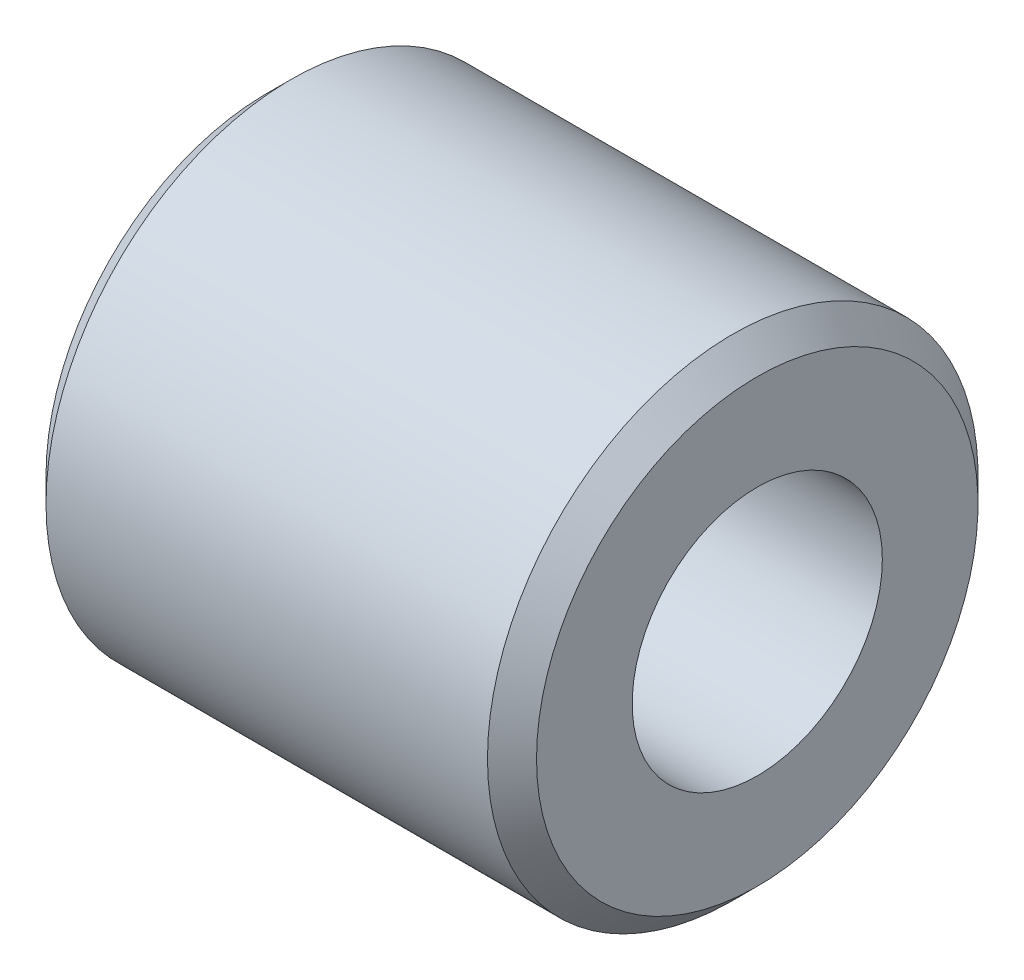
from build123d import *

# Parameters (mm, degrees)
TROU_TARAUD_M12X1_751_D = 10.2


with BuildPart() as part:
    # Esquisse1 → Base-R_volution (revolve)
    with BuildSketch(Plane.XY, mode=Mode.PRIVATE) as base_r_volution_sk:
        Polygon((0, 0), (-20, 0), (-20, 9), (-19, 10), (-1, 10), (0, 9), align=None)
    revolve(base_r_volution_sk.sketch.rotate(Axis((-22.039051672, 0, 0), (1, 0, 0)), 90), axis=Axis((-22.039051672, 0, 0), (1, 0, 0)))

    # Trou taraud_ M12x1.751 (through all)
    with Locations(Plane(origin=(0, 0, 0), x_dir=(0, 0, -1), z_dir=(1, 0, 0))):
        with Locations((0, 0)):
            Hole(TROU_TARAUD_M12X1_751_D / 2)


solid = part.part
